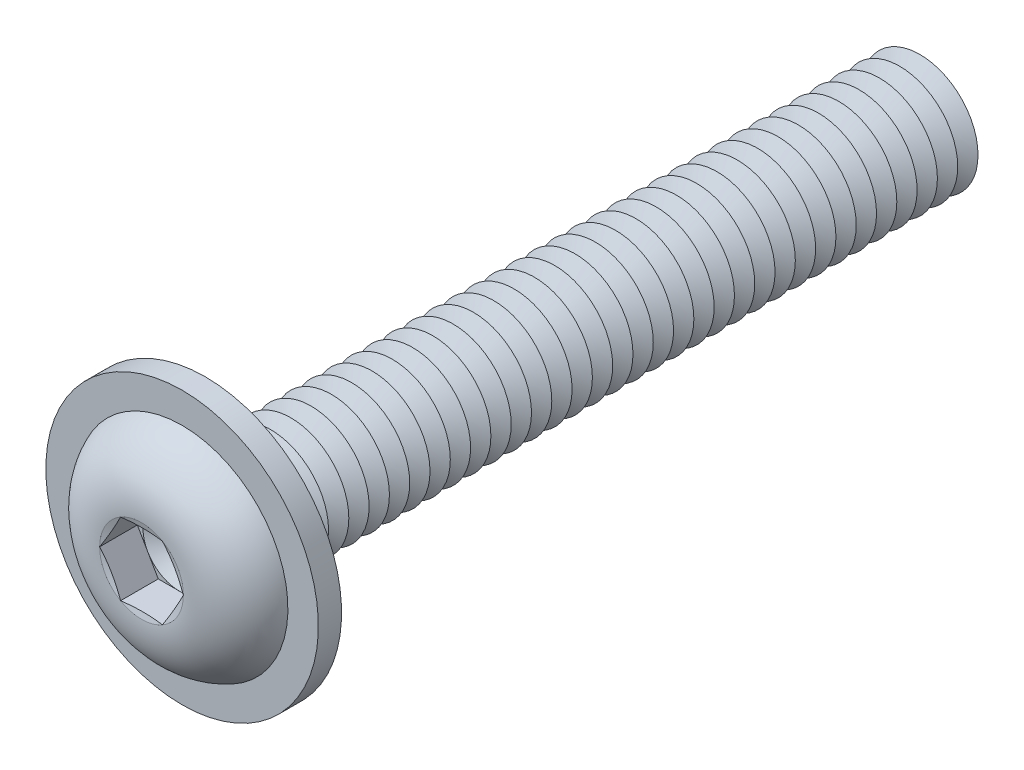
from build123d import *

# Parameters (mm, degrees)
FILLET1_R           = 0.35
LPATTERN1_COUNT     = 35
LPATTERN1_PITCH     = 0.7
CUT_EXTRUDE1_DEPTH  = 1.3
SKETCH5_R           = 4.7
SKETCH5_R_2         = 2.35
BOSS_EXTRUDE1_DEPTH = 0.8


with BuildPart() as part:
    # Sketch1 → Revolve1 (revolve)
    with BuildSketch(Plane(origin=(0, 0, 0), x_dir=(0, 0, -1), z_dir=(1, 0, 0)), mode=Mode.PRIVATE) as revolve1_sk:
        with BuildLine():
            Line((0, 2), (0, 3.8))
            ThreePointArc((0, 3.8), (-1.611961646, 3.099623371), (-2.2, 1.443375))
            Line((-2.2, 1.443375), (-2.006624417, 0.7216875))
            Line((-2.006624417, 0.7216875), (-2.2, 0.7216875))
            Line((-2.2, 0.7216875), (-2.2, 0))
            Line((-2.2, 0), (25, 0))
            Line((25, 0), (25, 2))
            Line((25, 2), (0, 2))
        make_face()
    revolve(revolve1_sk.sketch.rotate(Axis((0, 0, -25), (0, 0, 1)), 90), axis=Axis((0, 0, -25), (0, 0, 1)))

    # Fillet1
    fillet1_edges = [part.edges().sort_by_distance(p)[0] for p in [
        (2, 0, 0),
    ]]
    fillet(fillet1_edges, radius=FILLET1_R)

    # Sketch2 → Cut-Revolve1 (revolve, cut)
    with BuildSketch(Plane(origin=(0, 0, 0), x_dir=(0, 0, -1), z_dir=(1, 0, 0)), mode=Mode.PRIVATE) as cut_revolve1_sk:
        Polygon((24.65, 2), (25.35, 2), (25, 1.393782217), align=None)
    cut_revolve1 = revolve(cut_revolve1_sk.sketch.rotate(Axis((0, 0, -25), (0, 0, -1)), 270), axis=Axis((0, 0, -25), (0, 0, -1)), mode=Mode.SUBTRACT)

    # LPattern1: Cut-Revolve1 ×35
    with Locations(*[(0, 0, i * LPATTERN1_PITCH) for i in range(1, LPATTERN1_COUNT)]):
        add(cut_revolve1, mode=Mode.SUBTRACT)

    # Sketch3 → Cut-Extrude1 (cut)
    with BuildSketch(Plane.XY.offset(2.2)):
        Polygon((0.7216875, 1.249999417), (-0.7216875, 1.249999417), (-1.443375, 0), (-0.7216875, -1.249999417), (0.7216875, -1.249999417), (1.443375, 0), align=None)
    extrude(amount=-CUT_EXTRUDE1_DEPTH, mode=Mode.SUBTRACT)

    # Cut-Extrude2 cone 1 section (on through the dimple's axis) → Cut-Extrude2 (revolve, cut)
    with BuildSketch(Plane(origin=(0, 0, 0.9), x_dir=(0, -1, 0), z_dir=(1, 0, 0))):
        Polygon((0, 0), (1.249999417, 0), (0, 0.7216875), align=None)
    revolve(axis=Axis((0, 0, 0.9), (0, 0, -1)), mode=Mode.SUBTRACT)

    # Sketch5 → Boss-Extrude1 (add)
    with BuildSketch(Plane(origin=(0, 0, 0), x_dir=(-1, 0, 0), z_dir=(0, 0, -1))):
        with Locations(Location((0, 0, 0), (0, 0, 90))):
            Circle(SKETCH5_R)
        Circle(SKETCH5_R_2, mode=Mode.SUBTRACT)
    extrude(amount=-BOSS_EXTRUDE1_DEPTH)


solid = part.part
